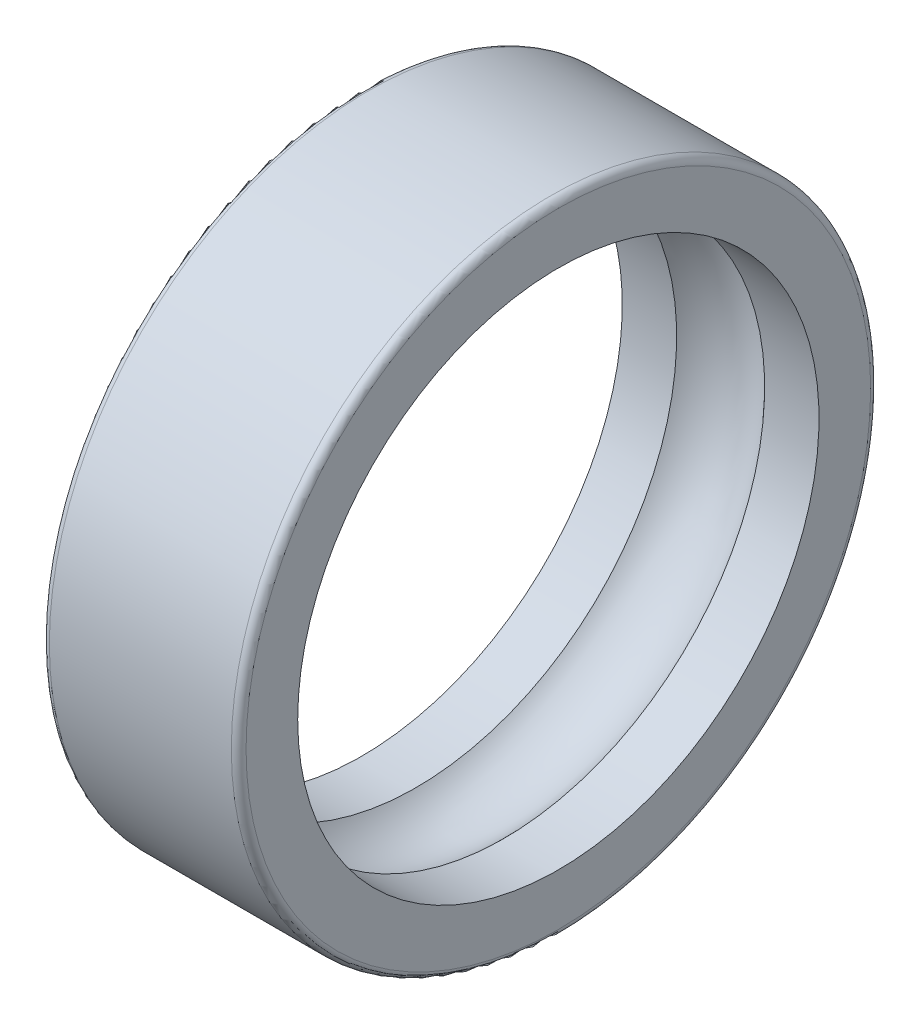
from build123d import *


with BuildPart() as part:
    # Esquisse1 → Base-R_volution (revolve)
    with BuildSketch(Plane(origin=(0, 0, 0), x_dir=(1, 0, 0), z_dir=(0, 1, 0)), mode=Mode.PRIVATE) as base_r_volution_sk:
        with BuildLine():
            Line((0, 12.7), (0, 10.6))
            Line((0, 10.6), (2.211145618, 10.6))
            ThreePointArc((2.211145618, 10.6), (4, 11.4), (5.788854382, 10.6))
            Line((5.788854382, 10.6), (8, 10.6))
            Line((8, 10.6), (8, 12.7))
            ThreePointArc((8, 12.7), (7.912132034, 12.912132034), (7.7, 13))
            Line((7.7, 13), (0.3, 13))
            ThreePointArc((0.3, 13), (0.087867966, 12.912132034), (0, 12.7))
        make_face()
    revolve(base_r_volution_sk.sketch.rotate(Axis((0, 0, 0), (1, 0, 0)), 180), axis=Axis((0, 0, 0), (1, 0, 0)))


solid = part.part
